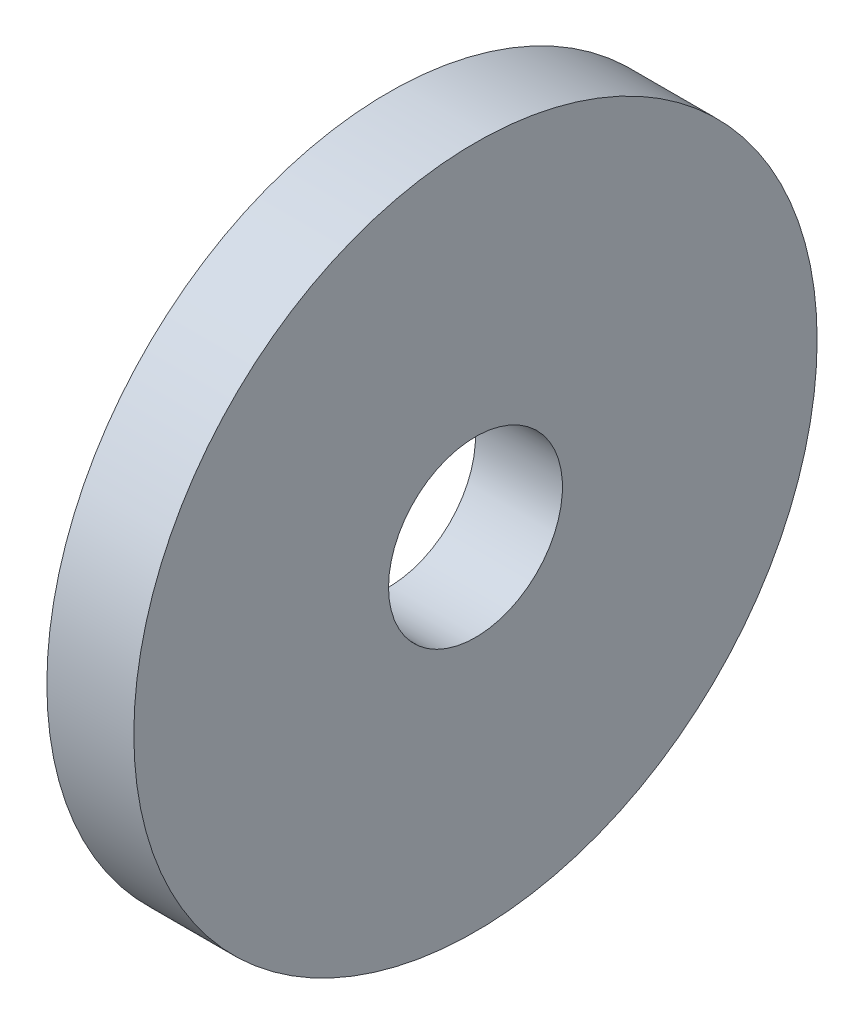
from build123d import *

# Parameters (mm, degrees)
ESQUISSE1_W = 7
ESQUISSE1_H = 20.5


with BuildPart() as part:
    # Esquisse1 → Base-R_volution (revolve)
    with BuildSketch(Plane(origin=(0, 0, 0), x_dir=(1, 0, 0), z_dir=(0, 1, 0)), mode=Mode.PRIVATE) as base_r_volution_sk:
        with Locations((3.5, 17.25)):
            Rectangle(ESQUISSE1_W, ESQUISSE1_H)
    revolve(base_r_volution_sk.sketch.rotate(Axis((0, 0, 0), (1, 0, 0)), 180), axis=Axis((0, 0, 0), (1, 0, 0)))


solid = part.part
